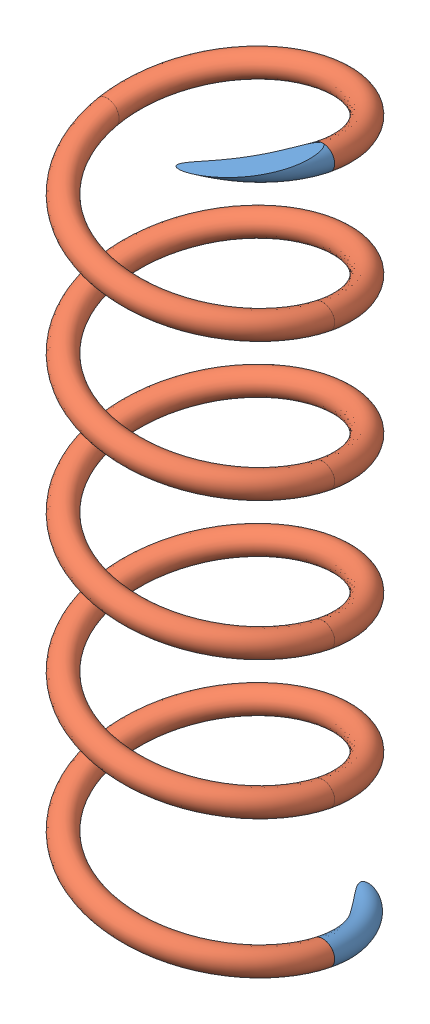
SolidWorks assembly Federung.SLDASM, configuration Varsayılan (file format 4400). Lengths in mm.
Overall size (100.65 319.05 102.6).
12 component instances, 2 part files, 38 mates.
Components (placement in the parent):
- Federboden-2: Federboden.SLDPRT [Varsayılan] at origin size (30.41 20.15 45.7)
- Federteil-1: Federteil.SLDPRT [Varsayılan] at (0.065 29.4462 0) x (-0.999924 -0.012316 0) z (0 0 -1) size (100.09 40.09 51.38)
- Federteil-2: Federteil.SLDPRT [Varsayılan] at (-0.4276 58.3354 0) x (0.999924 -0.012316 0) z (0 0 1) size (100.09 40.09 51.38)
- Federteil-3: Federteil.SLDPRT [Varsayılan] at (0.065 87.2247 0) x (-0.999924 -0.012316 0) z (0 0 -1) size (100.09 40.09 51.38)
- Federteil-4: Federteil.SLDPRT [Varsayılan] at (-0.4276 116.114 0) x (0.999924 -0.012316 0) z (0 0 1) size (100.09 40.09 51.38)
- Federteil-5: Federteil.SLDPRT [Varsayılan] at (0.065 145.0033 0) x (-0.999924 -0.012316 0) z (0 0 -1) size (100.09 40.09 51.38)
- Federteil-6: Federteil.SLDPRT [Varsayılan] at (-0.4276 173.8926 0) x (0.999924 -0.012316 0) z (0 0 1) size (100.09 40.09 51.38)
- Federteil-7: Federteil.SLDPRT [Varsayılan] at (-0.4276 231.6712 0) x (0.999924 -0.012316 0) z (0 0 1) size (100.09 40.09 51.38)
- Federteil-8: Federteil.SLDPRT [Varsayılan] at (0.065 202.7819 0) x (-0.999924 -0.012316 0) z (0 0 -1) size (100.09 40.09 51.38)
- Federteil-9: Federteil.SLDPRT [Varsayılan] at (0.065 260.5605 0) x (-0.999924 -0.012316 0) z (0 0 -1) size (100.09 40.09 51.38)
- Federteil-10: Federteil.SLDPRT [Varsayılan] at (-0.4276 289.4497 0) x (0.999924 -0.012316 0) z (0 0 1) size (100.09 40.09 51.38)
- Federboden-3: Federboden.SLDPRT [Varsayılan] at (0 358.8929 0) x (1 0 0) z (0 0 -1) size (30.41 20.15 45.7)
Mates (geometry in assembly coordinates):
- Çakışık1: coordinate: point of Federboden-2; point of assembly
- Eş Merkezli2: concentric aligned: circle of Federboden-2; circle of Federteil-1
- Çakışık6: coincident aligned: circle of Federboden-2; circle of Federteil-1
- Eş Merkezli3: concentric aligned: circle of Federteil-1; circle of Federteil-2
- Çakışık8: coincident aligned: circle of Federteil-1; circle of Federteil-2
- Eş Merkezli4: concentric aligned: circle of Federteil-2; circle of Federteil-3
- Çakışık10: coincident aligned: circle of Federteil-2; circle of Federteil-3
- Çakışık11: coincident: point of Federteil-3; line of assembly
- Paralel1: parallel aligned: line of Federteil-1 through (44.9384 39.9996 0) axis (-0.978785 0.204891 0); line of Federteil-3 through (44.9384 97.7782 0) axis (-0.978785 0.204891 0)
- Eş Merkezli5: concentric aligned: circle of Federteil-3; circle of Federteil-4
- Çakışık14: coincident aligned: circle of Federteil-3; circle of Federteil-4
- Çakışık16: coincident: point of Federteil-3; line of assembly
- Çakışık17: coincident: point of Federteil-4; line of assembly
- Paralel2: parallel aligned: line of Federteil-2 through (-45.3011 68.8889 0) axis (0.978785 0.204891 0); line of Federteil-4 through (-45.3011 126.6675 0) axis (0.978785 0.204891 0)
- Eş Merkezli6: concentric aligned: circle of Federteil-4; circle of Federteil-5
- Çakışık21: coincident aligned: circle of Federteil-4; circle of Federteil-5
- Eş Merkezli7: concentric aligned: circle of Federteil-5; circle of Federteil-6
- Çakışık23: coincident aligned: circle of Federteil-5; circle of Federteil-6
- Paralel3: parallel aligned: line of Federteil-3 through (44.9384 97.7782 0) axis (-0.978785 0.204891 0); line of Federteil-5 through (44.9384 155.5568 0) axis (-0.978785 0.204891 0)
- Çakışık25: coincident: point of Federteil-6; line of assembly
- Paralel4: parallel aligned: line of Federteil-4 through (-45.3011 126.6675 0) axis (0.978785 0.204891 0); line of Federteil-6 through (-45.3011 184.4461 0) axis (0.978785 0.204891 0)
- Eş Merkezli8: concentric aligned: circle of Federteil-6; circle of Federteil-8
- Çakışık28: coincident aligned: circle of Federteil-6; circle of Federteil-8
- Paralel5: parallel aligned: line of Federteil-5 through (44.9384 155.5568 0) axis (-0.978785 0.204891 0); line of Federteil-8 through (44.9384 213.3353 0) axis (-0.978785 0.204891 0)
- Eş Merkezli9: concentric aligned: circle of Federteil-7; circle of Federteil-8
- Çakışık31: coincident aligned: circle of Federteil-7; circle of Federteil-8
- Çakışık32: coincident: point of Federteil-7; line of assembly
- Paralel6: parallel aligned: line of Federteil-6 through (-45.3011 184.4461 0) axis (0.978785 0.204891 0); line of Federteil-7 through (-45.3011 242.2246 0) axis (0.978785 0.204891 0)
- Eş Merkezli10: concentric aligned: circle of Federteil-7; circle of Federteil-9
- Çakışık35: coincident aligned: circle of Federteil-7; circle of Federteil-9
- Paralel7: parallel aligned: line of Federteil-8 through (44.9384 213.3353 0) axis (-0.978785 0.204891 0); line of Federteil-9 through (44.9384 271.1139 0) axis (-0.978785 0.204891 0)
- Eş Merkezli11: concentric aligned: circle of Federteil-9; circle of Federteil-10
- Çakışık38: coincident aligned: circle of Federteil-9; circle of Federteil-10
- Çakışık39: coincident: point of Federteil-10; line of assembly
- Paralel8: parallel aligned: line of Federteil-7 through (-45.3011 242.2246 0) axis (0.978785 0.204891 0); line of Federteil-10 through (-45.3011 300.0032 0) axis (0.978785 0.204891 0)
- Eş Merkezli12: concentric anti-aligned: circle of Federteil-10; circle of Federboden-3
- Çakışık42: coincident anti-aligned: circle of Federteil-10; circle of Federboden-3
- Paralel9: parallel anti-aligned: plane of Federboden-2 through (59.4619 30 -60) normal (0 -1 0); plane of Federboden-3 through (59.4619 328.8929 60) normal (0 1 0)
